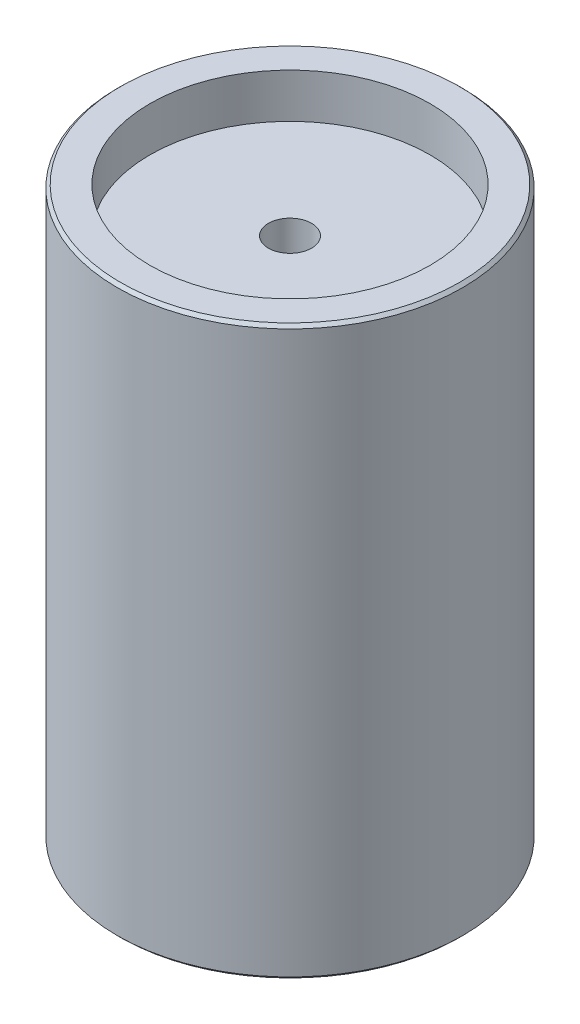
from build123d import *

# Parameters (mm, degrees)
CHAMFER1_SIZE                    = 0.7874
SKETCH3_R                        = 12.7
CUT_EXTRUDE2_DEPTH               = 1.27
F_7_16_20_TAPPED_HOLE1_D         = 11.1125
F_10_32_TAPPED_HOLE1_D           = 4.0386
F_10_32_TAPPED_HOLE1_DEPTH       = 10.16
F_10_32_TAPPED_HOLE1_CBORE_D     = 4.826
F_10_32_TAPPED_HOLE1_CBORE_DEPTH = 8.89
F_10_32_TAPPED_HOLE1_TIP         = 1.213317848


with BuildPart() as part:
    # Sketch1 → Revolve1 (revolve)
    with BuildSketch(Plane.XY, mode=Mode.PRIVATE) as revolve1_sk:
        Polygon((0, -146.05), (43.65625, -146.05), (44.45, -145.25625), (44.45, 0), (36.068, 0), (36.068, -11.43), (0, -11.43), align=None)
    revolve(revolve1_sk.sketch.rotate(Axis((0, 0, 0), (0, -1, 0)), 180), axis=Axis((0, 0, 0), (0, -1, 0)))

    # Chamfer1
    chamfer1_edges = [part.edges().sort_by_distance(p)[0] for p in [
        (44.45, 0, 0),
    ]]
    chamfer(chamfer1_edges, length=CHAMFER1_SIZE)

    # Sketch3 → Cut-Extrude2 (cut)
    with BuildSketch(Plane.XZ.offset(146.05)):
        Circle(SKETCH3_R)
    extrude(amount=-CUT_EXTRUDE2_DEPTH, mode=Mode.SUBTRACT)

    # 7_16-20 Tapped Hole1 (through all)
    with Locations(Plane(origin=(0, -144.78, 0), x_dir=(-1, 0, 0), z_dir=(0, -1, 0))):
        with Locations((0, 0)):
            Hole(F_7_16_20_TAPPED_HOLE1_D / 2)

    # 10-32 Tapped Hole1
    with Locations(Plane(origin=(0, -146.05, 31.75), x_dir=(-1, 0, 0), z_dir=(0, -1, 0))):
        with Locations((0, 0)):
            CounterBoreHole(F_10_32_TAPPED_HOLE1_D / 2, F_10_32_TAPPED_HOLE1_CBORE_D / 2, F_10_32_TAPPED_HOLE1_CBORE_DEPTH, depth=F_10_32_TAPPED_HOLE1_DEPTH)
            with Locations((0, 0, -(F_10_32_TAPPED_HOLE1_DEPTH + F_10_32_TAPPED_HOLE1_TIP / 2))):  # 118° drill point
                Cone(0, F_10_32_TAPPED_HOLE1_D / 2, F_10_32_TAPPED_HOLE1_TIP, mode=Mode.SUBTRACT)


solid = part.part
